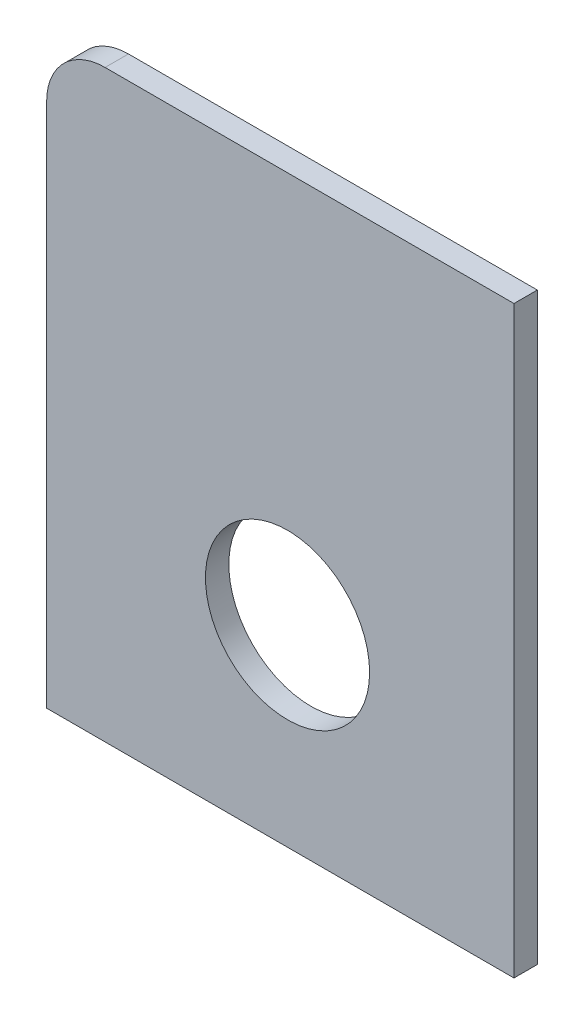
from build123d import *

# Parameters (mm, degrees)
SKETCH1_R      = 8.923568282
EXTRUDE1_DEPTH = 2.54


with BuildPart() as part:
    # Sketch1 → Extrude1 (new body)
    with BuildSketch(Plane.XY):
        with BuildLine():
            Line((0, 0), (-50.8, 0))
            Line((-50.8, 0), (-50.8, 57.15))
            ThreePointArc((-50.8, 57.15), (-48.940128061, 61.640128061), (-44.45, 63.5))
            Line((-44.45, 63.5), (0, 63.5))
            Line((0, 63.5), (0, 0))
        make_face()
        with Locations((-24.616740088, 20.924229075)):
            Circle(SKETCH1_R, mode=Mode.SUBTRACT)
    extrude(amount=EXTRUDE1_DEPTH)


solid = part.part
